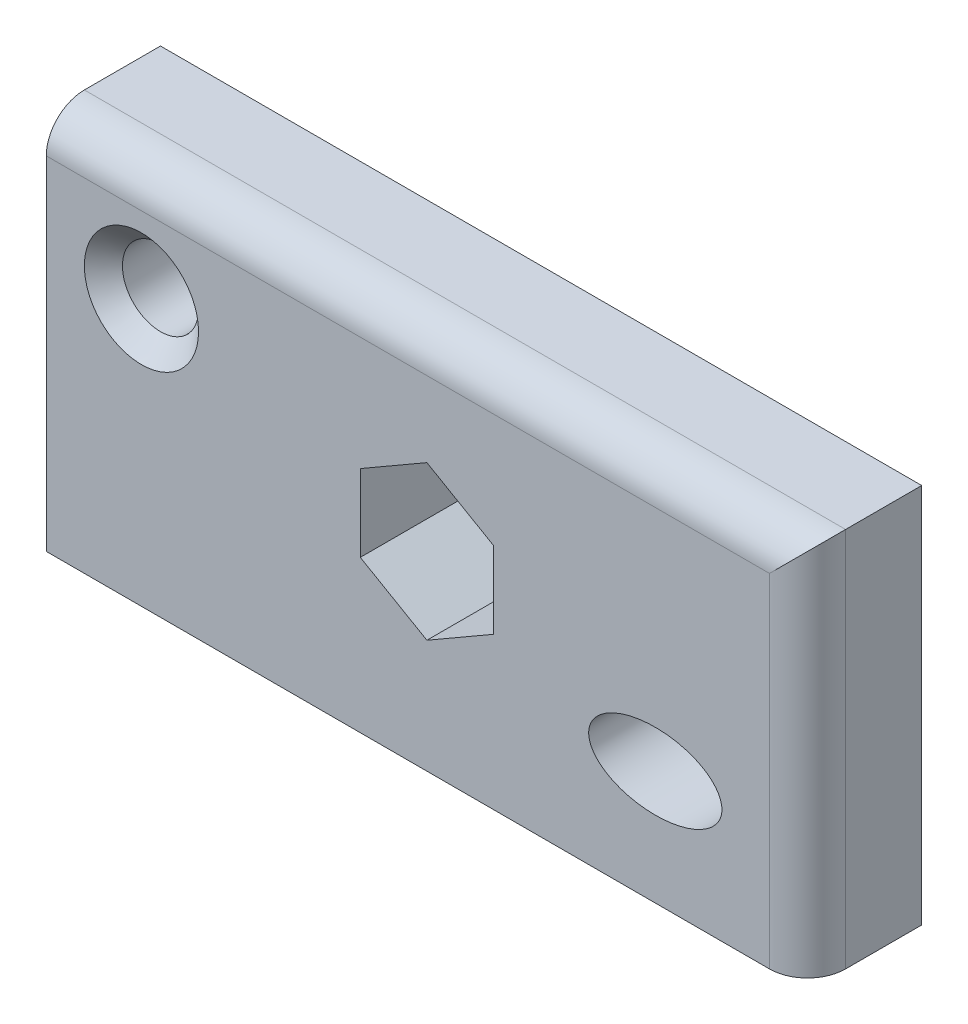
from build123d import *

# Parameters (mm, degrees)
SZKIC1_W                    = 200
SZKIC1_H                    = 100
DODANIE_WYCI_GNI_CIE1_DEPTH = 30
SZKIC2_R                    = 10
WYTNIJ_WYCI_GNI_CIE1_DEPTH  = 116.758369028
WYTNIJ_WYCI_GNI_CIE2_DEPTH  = 116.758369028
SZKIC4_RX                   = 17.5
SZKIC4_RY                   = 10
WYTNIJ_WYCI_GNI_CIE3_DEPTH  = 116.758369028
ZAOKR_GLENIE1_R             = 10
SFAZOWANIE1_SIZE            = 5


with BuildPart() as part:
    # Szkic1 → Dodanie-wyci_gni_cie1 (new body)
    with BuildSketch(Plane.XY):
        Rectangle(SZKIC1_W, SZKIC1_H)
    extrude(amount=DODANIE_WYCI_GNI_CIE1_DEPTH)

    # Szkic2 → Wytnij-wyci_gni_cie1 (cut, through all)
    with BuildSketch(Plane.XY.offset(30)):
        with Locations((-75, 20)):
            Circle(SZKIC2_R)
    extrude(amount=-WYTNIJ_WYCI_GNI_CIE1_DEPTH, mode=Mode.SUBTRACT)

    # Szkic3 → Wytnij-wyci_gni_cie2 (cut, through all)
    with BuildSketch(Plane.XY.offset(30)):
        Polygon((-17.5, 10.103629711), (-17.5, -10.103629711), (0, -20.207259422), (17.5, -10.103629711), (17.5, 10.103629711), (0, 20.207259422), align=None)
    extrude(amount=-WYTNIJ_WYCI_GNI_CIE2_DEPTH, mode=Mode.SUBTRACT)

    # Szkic4 → Wytnij-wyci_gni_cie3 (cut, through all)
    with BuildSketch(Plane.XY.offset(30)):
        with Locations((60, -20)):
            Ellipse(SZKIC4_RX, SZKIC4_RY)
    extrude(amount=-WYTNIJ_WYCI_GNI_CIE3_DEPTH, mode=Mode.SUBTRACT)

    # Zaokr_glenie1
    zaokr_glenie1_edges = [part.edges().sort_by_distance(p)[0] for p in [
        (100, 0, 30),
        (0, 50, 30),
    ]]
    fillet(zaokr_glenie1_edges, radius=ZAOKR_GLENIE1_R)

    # Sfazowanie1
    sfazowanie1_edges = [part.edges().sort_by_distance(p)[0] for p in [
        (-85, 20, 30),
    ]]
    chamfer(sfazowanie1_edges, length=SFAZOWANIE1_SIZE)


solid = part.part
